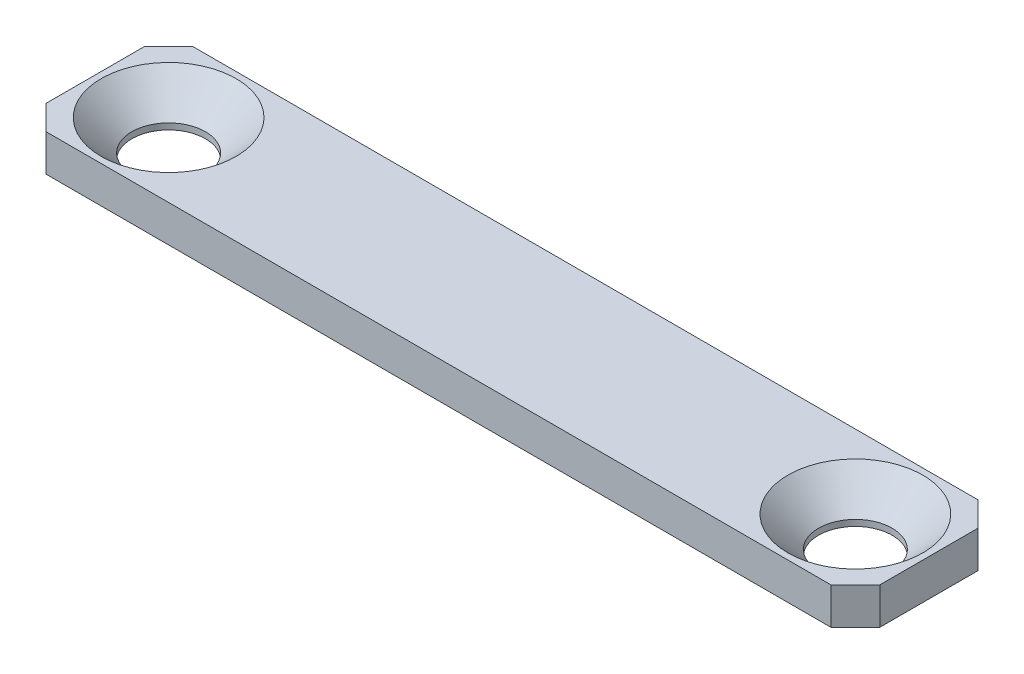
from build123d import *

# Parameters (mm, degrees)
SKETCH_1_W                   = 34
SKETCH_1_H                   = 6
EXTRUDE_1_DEPTH              = 1.5
HOLE_WIZARD_M2_51_AT_2_COUNT = 2
HOLE_WIZARD_M2_51_AT_2_PITCH = 28
CHAMFER_2_SIZE               = 1


with BuildPart() as part:
    # Sketch 1 → Extrude 1 (new body)
    with BuildSketch(Plane(origin=(0, 0, 0), x_dir=(1, 0, 0), z_dir=(0, 1, 0))):
        with Locations((17, 3)):
            Rectangle(SKETCH_1_W, SKETCH_1_H)
    extrude(amount=EXTRUDE_1_DEPTH)

    # Sketch 2 → Hole Wizard M2.51 (revolve, cut)
    with BuildSketch(Plane(origin=(3, 1.5, -3), x_dir=(0, 0, 1), z_dir=(1, 0, 0))):
        Polygon((0, 0), (0, 1.5), (1.5, 1.5), (1.5, 1.25), (2.75, 0), align=None)
    hole_wizard_m2_51 = revolve(axis=Axis((3, 7.85, -3), (0, -1, 0)), mode=Mode.SUBTRACT)

    # Hole Wizard M2.51 at 2: Hole Wizard M2.51 ×2
    with Locations(*[(i * HOLE_WIZARD_M2_51_AT_2_PITCH, 0, 0) for i in range(1, HOLE_WIZARD_M2_51_AT_2_COUNT)]):
        add(hole_wizard_m2_51, mode=Mode.SUBTRACT)

    # Chamfer 2
    chamfer_2_edges = [part.edges().sort_by_distance(p)[0] for p in [
        (0, 0.75, -6),
        (34, 0.75, -6),
        (34, 0.75, 0),
        (0, 0.75, 0),
    ]]
    chamfer(chamfer_2_edges, length=CHAMFER_2_SIZE)


solid = part.part
